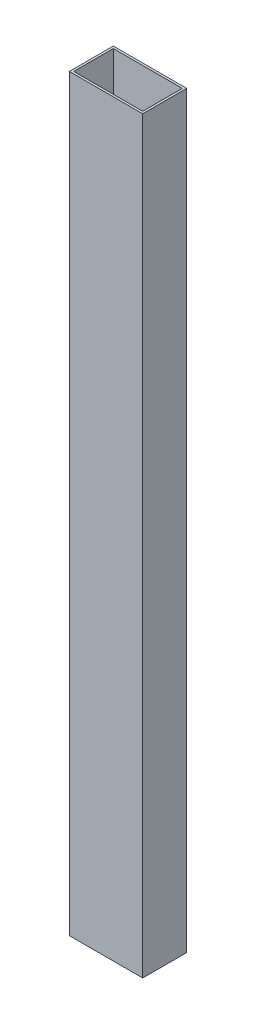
ISO-10303-21;
HEADER;
FILE_DESCRIPTION(('STEP AP214'),'2;1');
FILE_NAME('part.step','',(''),(''),'','','');
FILE_SCHEMA(('AUTOMOTIVE_DESIGN { 1 0 10303 214 1 1 1 1 }'));
ENDSEC;
DATA;
#1=APPLICATION_CONTEXT('core data for automotive mechanical design processes');
#2=APPLICATION_PROTOCOL_DEFINITION('international standard','automotive_design',2000,#1);
#3=PRODUCT_CONTEXT('',#1,'mechanical');
#4=PRODUCT('Part','Part','',(#3));
#5=PRODUCT_RELATED_PRODUCT_CATEGORY('part','',(#4));
#6=PRODUCT_DEFINITION_FORMATION('','',#4);
#7=PRODUCT_DEFINITION_CONTEXT('part definition',#1,'design');
#8=PRODUCT_DEFINITION('design','',#6,#7);
#9=PRODUCT_DEFINITION_SHAPE('','',#8);
#10=(LENGTH_UNIT() NAMED_UNIT(*) SI_UNIT(.MILLI.,.METRE.));
#11=(NAMED_UNIT(*) PLANE_ANGLE_UNIT() SI_UNIT($,.RADIAN.));
#12=(NAMED_UNIT(*) SI_UNIT($,.STERADIAN.) SOLID_ANGLE_UNIT());
#13=UNCERTAINTY_MEASURE_WITH_UNIT(LENGTH_MEASURE(1.E-05),#10,'distance_accuracy_value','');
#14=(GEOMETRIC_REPRESENTATION_CONTEXT(3) GLOBAL_UNCERTAINTY_ASSIGNED_CONTEXT((#13)) GLOBAL_UNIT_ASSIGNED_CONTEXT((#10,
#11,#12)) REPRESENTATION_CONTEXT('',''));
#15=CARTESIAN_POINT('',(0.,0.,0.));
#16=DIRECTION('',(0.,0.,1.));
#17=DIRECTION('',(1.,0.,0.));
#18=AXIS2_PLACEMENT_3D('',#15,#16,#17);
#19=CARTESIAN_POINT('',(25.,510.,-15.));
#20=DIRECTION('',(-1.,0.,0.));
#21=DIRECTION('',(0.,0.,1.));
#22=AXIS2_PLACEMENT_3D('',#19,#20,#21);
#23=PLANE('',#22);
#24=DIRECTION('',(0.,0.,-1.));
#25=VECTOR('',#24,1.);
#26=CARTESIAN_POINT('',(25.,0.,-15.));
#27=LINE('',#26,#25);
#28=CARTESIAN_POINT('',(25.,0.,15.));
#29=VERTEX_POINT('',#28);
#30=CARTESIAN_POINT('',(25.,0.,-15.));
#31=VERTEX_POINT('',#30);
#32=EDGE_CURVE('E142',#29,#31,#27,.T.);
#33=ORIENTED_EDGE('',*,*,#32,.T.);
#34=DIRECTION('',(0.,-1.,0.));
#35=VECTOR('',#34,1.);
#36=CARTESIAN_POINT('',(25.,510.,-15.));
#37=LINE('',#36,#35);
#38=CARTESIAN_POINT('',(25.,510.,-15.));
#39=VERTEX_POINT('',#38);
#40=EDGE_CURVE('E11',#39,#31,#37,.T.);
#41=ORIENTED_EDGE('',*,*,#40,.F.);
#42=DIRECTION('',(0.,0.,-1.));
#43=VECTOR('',#42,1.);
#44=CARTESIAN_POINT('',(25.,510.,-15.));
#45=LINE('',#44,#43);
#46=CARTESIAN_POINT('',(25.,510.,15.));
#47=VERTEX_POINT('',#46);
#48=EDGE_CURVE('E131',#47,#39,#45,.T.);
#49=ORIENTED_EDGE('',*,*,#48,.F.);
#50=DIRECTION('',(0.,-1.,0.));
#51=VECTOR('',#50,1.);
#52=CARTESIAN_POINT('',(25.,510.,15.));
#53=LINE('',#52,#51);
#54=EDGE_CURVE('E141',#47,#29,#53,.T.);
#55=ORIENTED_EDGE('',*,*,#54,.T.);
#56=EDGE_LOOP('',(#33,#41,#49,#55));
#57=FACE_BOUND('',#56,.T.);
#58=ADVANCED_FACE('F34',(#57),#23,.F.);
#59=CARTESIAN_POINT('',(-25.,510.,-15.));
#60=DIRECTION('',(0.,0.,1.));
#61=DIRECTION('',(1.,0.,0.));
#62=AXIS2_PLACEMENT_3D('',#59,#60,#61);
#63=PLANE('',#62);
#64=DIRECTION('',(-1.,0.,0.));
#65=VECTOR('',#64,1.);
#66=CARTESIAN_POINT('',(-25.,0.,-15.));
#67=LINE('',#66,#65);
#68=CARTESIAN_POINT('',(-25.,0.,-15.));
#69=VERTEX_POINT('',#68);
#70=EDGE_CURVE('E145',#31,#69,#67,.T.);
#71=ORIENTED_EDGE('',*,*,#70,.T.);
#72=DIRECTION('',(0.,-1.,0.));
#73=VECTOR('',#72,1.);
#74=CARTESIAN_POINT('',(-25.,510.,-15.));
#75=LINE('',#74,#73);
#76=CARTESIAN_POINT('',(-25.,510.,-15.));
#77=VERTEX_POINT('',#76);
#78=EDGE_CURVE('E41',#77,#69,#75,.T.);
#79=ORIENTED_EDGE('',*,*,#78,.F.);
#80=DIRECTION('',(-1.,0.,0.));
#81=VECTOR('',#80,1.);
#82=CARTESIAN_POINT('',(-25.,510.,-15.));
#83=LINE('',#82,#81);
#84=EDGE_CURVE('E134',#39,#77,#83,.T.);
#85=ORIENTED_EDGE('',*,*,#84,.F.);
#86=ORIENTED_EDGE('',*,*,#40,.T.);
#87=EDGE_LOOP('',(#71,#79,#85,#86));
#88=FACE_BOUND('',#87,.T.);
#89=ADVANCED_FACE('F173',(#88),#63,.F.);
#90=CARTESIAN_POINT('',(-25.,510.,-15.));
#91=DIRECTION('',(1.,0.,0.));
#92=DIRECTION('',(0.,0.,-1.));
#93=AXIS2_PLACEMENT_3D('',#90,#91,#92);
#94=PLANE('',#93);
#95=DIRECTION('',(0.,0.,1.));
#96=VECTOR('',#95,1.);
#97=CARTESIAN_POINT('',(-25.,0.,-15.));
#98=LINE('',#97,#96);
#99=CARTESIAN_POINT('',(-25.,0.,15.));
#100=VERTEX_POINT('',#99);
#101=EDGE_CURVE('E147',#69,#100,#98,.T.);
#102=ORIENTED_EDGE('',*,*,#101,.T.);
#103=DIRECTION('',(0.,-1.,0.));
#104=VECTOR('',#103,1.);
#105=CARTESIAN_POINT('',(-25.,510.,15.));
#106=LINE('',#105,#104);
#107=CARTESIAN_POINT('',(-25.,510.,15.));
#108=VERTEX_POINT('',#107);
#109=EDGE_CURVE('E152',#108,#100,#106,.T.);
#110=ORIENTED_EDGE('',*,*,#109,.F.);
#111=DIRECTION('',(0.,0.,1.));
#112=VECTOR('',#111,1.);
#113=CARTESIAN_POINT('',(-25.,510.,-15.));
#114=LINE('',#113,#112);
#115=EDGE_CURVE('E137',#77,#108,#114,.T.);
#116=ORIENTED_EDGE('',*,*,#115,.F.);
#117=ORIENTED_EDGE('',*,*,#78,.T.);
#118=EDGE_LOOP('',(#102,#110,#116,#117));
#119=FACE_BOUND('',#118,.T.);
#120=ADVANCED_FACE('F159',(#119),#94,.F.);
#121=CARTESIAN_POINT('',(-25.,510.,15.));
#122=DIRECTION('',(0.,0.,-1.));
#123=DIRECTION('',(-1.,0.,0.));
#124=AXIS2_PLACEMENT_3D('',#121,#122,#123);
#125=PLANE('',#124);
#126=DIRECTION('',(1.,0.,0.));
#127=VECTOR('',#126,1.);
#128=CARTESIAN_POINT('',(-25.,0.,15.));
#129=LINE('',#128,#127);
#130=EDGE_CURVE('E135',#100,#29,#129,.T.);
#131=ORIENTED_EDGE('',*,*,#130,.T.);
#132=ORIENTED_EDGE('',*,*,#54,.F.);
#133=DIRECTION('',(1.,0.,0.));
#134=VECTOR('',#133,1.);
#135=CARTESIAN_POINT('',(-25.,510.,15.));
#136=LINE('',#135,#134);
#137=EDGE_CURVE('E139',#108,#47,#136,.T.);
#138=ORIENTED_EDGE('',*,*,#137,.F.);
#139=ORIENTED_EDGE('',*,*,#109,.T.);
#140=EDGE_LOOP('',(#131,#132,#138,#139));
#141=FACE_BOUND('',#140,.T.);
#142=ADVANCED_FACE('F166',(#141),#125,.F.);
#143=CARTESIAN_POINT('',(0.,510.,0.));
#144=DIRECTION('',(0.,1.,0.));
#145=DIRECTION('',(0.,0.,1.));
#146=AXIS2_PLACEMENT_3D('',#143,#144,#145);
#147=PLANE('',#146);
#148=DIRECTION('',(0.,0.,-1.));
#149=VECTOR('',#148,1.);
#150=CARTESIAN_POINT('',(23.5,510.,-15.));
#151=LINE('',#150,#149);
#152=CARTESIAN_POINT('',(23.5,510.,13.5));
#153=VERTEX_POINT('',#152);
#154=CARTESIAN_POINT('',(23.5,510.,-13.5));
#155=VERTEX_POINT('',#154);
#156=EDGE_CURVE('E119',#153,#155,#151,.T.);
#157=ORIENTED_EDGE('',*,*,#156,.F.);
#158=DIRECTION('',(1.,0.,0.));
#159=VECTOR('',#158,1.);
#160=CARTESIAN_POINT('',(-25.,510.,13.5));
#161=LINE('',#160,#159);
#162=CARTESIAN_POINT('',(-23.5,510.,13.5));
#163=VERTEX_POINT('',#162);
#164=EDGE_CURVE('E103',#163,#153,#161,.T.);
#165=ORIENTED_EDGE('',*,*,#164,.F.);
#166=DIRECTION('',(0.,0.,1.));
#167=VECTOR('',#166,1.);
#168=CARTESIAN_POINT('',(-23.5,510.,-15.));
#169=LINE('',#168,#167);
#170=CARTESIAN_POINT('',(-23.5,510.,-13.5));
#171=VERTEX_POINT('',#170);
#172=EDGE_CURVE('E128',#171,#163,#169,.T.);
#173=ORIENTED_EDGE('',*,*,#172,.F.);
#174=DIRECTION('',(-1.,0.,0.));
#175=VECTOR('',#174,1.);
#176=CARTESIAN_POINT('',(-25.,510.,-13.5));
#177=LINE('',#176,#175);
#178=EDGE_CURVE('E121',#155,#171,#177,.T.);
#179=ORIENTED_EDGE('',*,*,#178,.F.);
#180=EDGE_LOOP('',(#157,#165,#173,#179));
#181=FACE_BOUND('',#180,.T.);
#182=ORIENTED_EDGE('',*,*,#48,.T.);
#183=ORIENTED_EDGE('',*,*,#84,.T.);
#184=ORIENTED_EDGE('',*,*,#115,.T.);
#185=ORIENTED_EDGE('',*,*,#137,.T.);
#186=EDGE_LOOP('',(#182,#183,#184,#185));
#187=FACE_BOUND('',#186,.T.);
#188=ADVANCED_FACE('F172',(#181,#187),#147,.T.);
#189=CARTESIAN_POINT('',(0.,0.,0.));
#190=DIRECTION('',(0.,1.,0.));
#191=DIRECTION('',(0.,0.,1.));
#192=AXIS2_PLACEMENT_3D('',#189,#190,#191);
#193=PLANE('',#192);
#194=DIRECTION('',(1.,0.,0.));
#195=VECTOR('',#194,1.);
#196=CARTESIAN_POINT('',(-25.,0.,13.5));
#197=LINE('',#196,#195);
#198=CARTESIAN_POINT('',(-23.5,0.,13.5));
#199=VERTEX_POINT('',#198);
#200=CARTESIAN_POINT('',(23.5,0.,13.5));
#201=VERTEX_POINT('',#200);
#202=EDGE_CURVE('E101',#199,#201,#197,.T.);
#203=ORIENTED_EDGE('',*,*,#202,.T.);
#204=DIRECTION('',(0.,0.,-1.));
#205=VECTOR('',#204,1.);
#206=CARTESIAN_POINT('',(23.5,0.,-15.));
#207=LINE('',#206,#205);
#208=CARTESIAN_POINT('',(23.5,0.,-13.5));
#209=VERTEX_POINT('',#208);
#210=EDGE_CURVE('E109',#201,#209,#207,.T.);
#211=ORIENTED_EDGE('',*,*,#210,.T.);
#212=DIRECTION('',(-1.,0.,0.));
#213=VECTOR('',#212,1.);
#214=CARTESIAN_POINT('',(-25.,0.,-13.5));
#215=LINE('',#214,#213);
#216=CARTESIAN_POINT('',(-23.5,0.,-13.5));
#217=VERTEX_POINT('',#216);
#218=EDGE_CURVE('E115',#209,#217,#215,.T.);
#219=ORIENTED_EDGE('',*,*,#218,.T.);
#220=DIRECTION('',(0.,0.,1.));
#221=VECTOR('',#220,1.);
#222=CARTESIAN_POINT('',(-23.5,0.,-15.));
#223=LINE('',#222,#221);
#224=EDGE_CURVE('E55',#217,#199,#223,.T.);
#225=ORIENTED_EDGE('',*,*,#224,.T.);
#226=EDGE_LOOP('',(#203,#211,#219,#225));
#227=FACE_BOUND('',#226,.T.);
#228=ORIENTED_EDGE('',*,*,#32,.F.);
#229=ORIENTED_EDGE('',*,*,#130,.F.);
#230=ORIENTED_EDGE('',*,*,#101,.F.);
#231=ORIENTED_EDGE('',*,*,#70,.F.);
#232=EDGE_LOOP('',(#228,#229,#230,#231));
#233=FACE_BOUND('',#232,.T.);
#234=ADVANCED_FACE('F117',(#227,#233),#193,.F.);
#235=CARTESIAN_POINT('',(23.5,510.,-15.));
#236=DIRECTION('',(-1.,0.,0.));
#237=DIRECTION('',(0.,0.,1.));
#238=AXIS2_PLACEMENT_3D('',#235,#236,#237);
#239=PLANE('',#238);
#240=ORIENTED_EDGE('',*,*,#210,.F.);
#241=DIRECTION('',(0.,-1.,0.));
#242=VECTOR('',#241,1.);
#243=CARTESIAN_POINT('',(23.5,510.,13.5));
#244=LINE('',#243,#242);
#245=EDGE_CURVE('E97',#153,#201,#244,.T.);
#246=ORIENTED_EDGE('',*,*,#245,.F.);
#247=ORIENTED_EDGE('',*,*,#156,.T.);
#248=DIRECTION('',(0.,-1.,0.));
#249=VECTOR('',#248,1.);
#250=CARTESIAN_POINT('',(23.5,510.,-13.5));
#251=LINE('',#250,#249);
#252=EDGE_CURVE('E112',#155,#209,#251,.T.);
#253=ORIENTED_EDGE('',*,*,#252,.T.);
#254=EDGE_LOOP('',(#240,#246,#247,#253));
#255=FACE_BOUND('',#254,.T.);
#256=ADVANCED_FACE('F110',(#255),#239,.T.);
#257=CARTESIAN_POINT('',(-25.,510.,-13.5));
#258=DIRECTION('',(0.,0.,1.));
#259=DIRECTION('',(1.,0.,0.));
#260=AXIS2_PLACEMENT_3D('',#257,#258,#259);
#261=PLANE('',#260);
#262=ORIENTED_EDGE('',*,*,#218,.F.);
#263=ORIENTED_EDGE('',*,*,#252,.F.);
#264=ORIENTED_EDGE('',*,*,#178,.T.);
#265=DIRECTION('',(0.,-1.,0.));
#266=VECTOR('',#265,1.);
#267=CARTESIAN_POINT('',(-23.5,510.,-13.5));
#268=LINE('',#267,#266);
#269=EDGE_CURVE('E257',#171,#217,#268,.T.);
#270=ORIENTED_EDGE('',*,*,#269,.T.);
#271=EDGE_LOOP('',(#262,#263,#264,#270));
#272=FACE_BOUND('',#271,.T.);
#273=ADVANCED_FACE('F193',(#272),#261,.T.);
#274=CARTESIAN_POINT('',(-23.5,510.,-15.));
#275=DIRECTION('',(1.,0.,0.));
#276=DIRECTION('',(0.,0.,-1.));
#277=AXIS2_PLACEMENT_3D('',#274,#275,#276);
#278=PLANE('',#277);
#279=ORIENTED_EDGE('',*,*,#224,.F.);
#280=ORIENTED_EDGE('',*,*,#269,.F.);
#281=ORIENTED_EDGE('',*,*,#172,.T.);
#282=DIRECTION('',(0.,-1.,0.));
#283=VECTOR('',#282,1.);
#284=CARTESIAN_POINT('',(-23.5,510.,13.5));
#285=LINE('',#284,#283);
#286=EDGE_CURVE('E48',#163,#199,#285,.T.);
#287=ORIENTED_EDGE('',*,*,#286,.T.);
#288=EDGE_LOOP('',(#279,#280,#281,#287));
#289=FACE_BOUND('',#288,.T.);
#290=ADVANCED_FACE('F190',(#289),#278,.T.);
#291=CARTESIAN_POINT('',(-25.,510.,13.5));
#292=DIRECTION('',(0.,0.,-1.));
#293=DIRECTION('',(-1.,0.,0.));
#294=AXIS2_PLACEMENT_3D('',#291,#292,#293);
#295=PLANE('',#294);
#296=ORIENTED_EDGE('',*,*,#202,.F.);
#297=ORIENTED_EDGE('',*,*,#286,.F.);
#298=ORIENTED_EDGE('',*,*,#164,.T.);
#299=ORIENTED_EDGE('',*,*,#245,.T.);
#300=EDGE_LOOP('',(#296,#297,#298,#299));
#301=FACE_BOUND('',#300,.T.);
#302=ADVANCED_FACE('F99',(#301),#295,.T.);
#303=CLOSED_SHELL('',(#58,#89,#120,#142,#188,#234,#256,#273,#290,#302));
#304=MANIFOLD_SOLID_BREP('B2',#303);
#305=ADVANCED_BREP_SHAPE_REPRESENTATION('',(#18,#304),#14);
#306=SHAPE_DEFINITION_REPRESENTATION(#9,#305);
ENDSEC;
END-ISO-10303-21;
